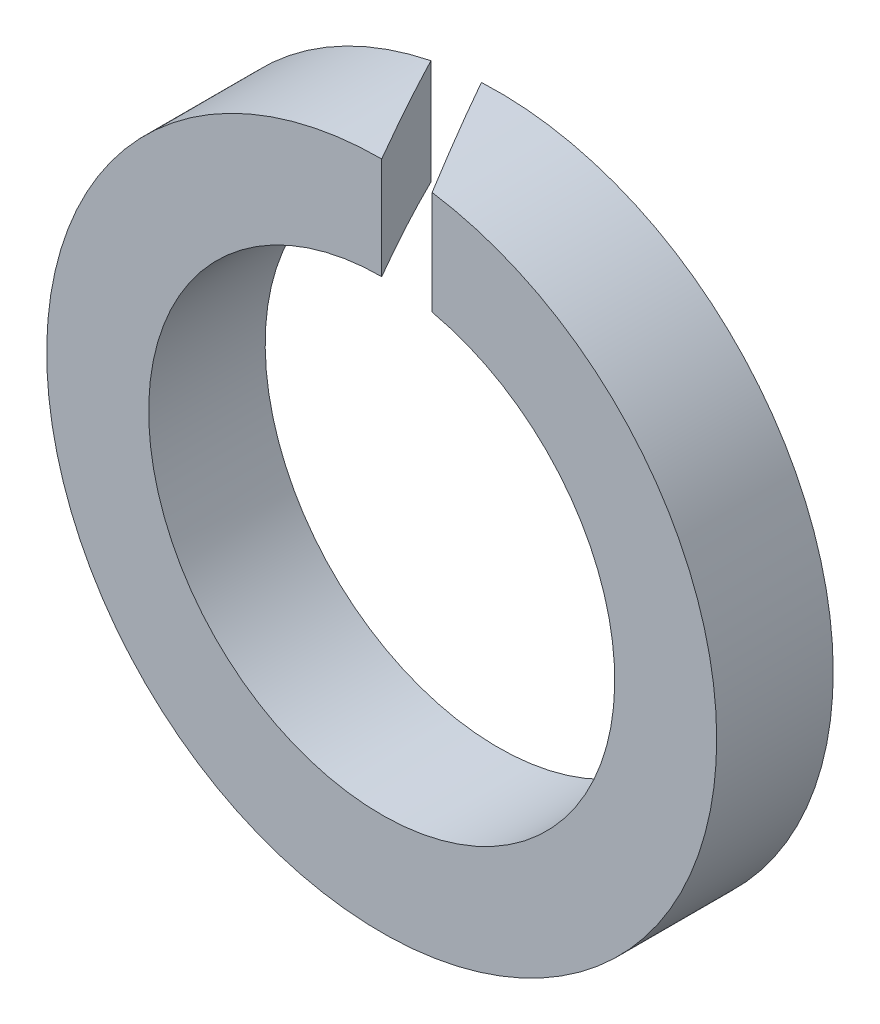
from build123d import *

# Parameters (mm, degrees)
ESQUISSE1_R             = 11.5
BASE_EXTRUSION_DEPTH    = 4
ESQUISSE2_R             = 8
ENL_V_MAT_EXTRU_1_DEPTH = 6
ENL_V_MAT_EXTRU_2_DEPTH = 10


with BuildPart() as part:
    # Esquisse1 → Base-Extrusion (new body)
    with BuildSketch(Plane.XY):
        Circle(ESQUISSE1_R)
    extrude(amount=-BASE_EXTRUSION_DEPTH)

    # Esquisse2 → Enl_v. mat.-Extru.1 (cut)
    with BuildSketch(Plane.XY):
        Circle(ESQUISSE2_R)
    extrude(amount=-ENL_V_MAT_EXTRU_1_DEPTH, mode=Mode.SUBTRACT)

    # Esquisse3 → Enl_v. mat.-Extru.2 (cut)
    with BuildSketch(Plane(origin=(0, 11.5, 0), x_dir=(-1, 0, 0), z_dir=(0, 1, 0))):
        Polygon((0, 0), (3.319764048, -5.75), (1.58771324, -5.75), (-1.732050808, 0), align=None)
    extrude(amount=-ENL_V_MAT_EXTRU_2_DEPTH, mode=Mode.SUBTRACT)


solid = part.part
